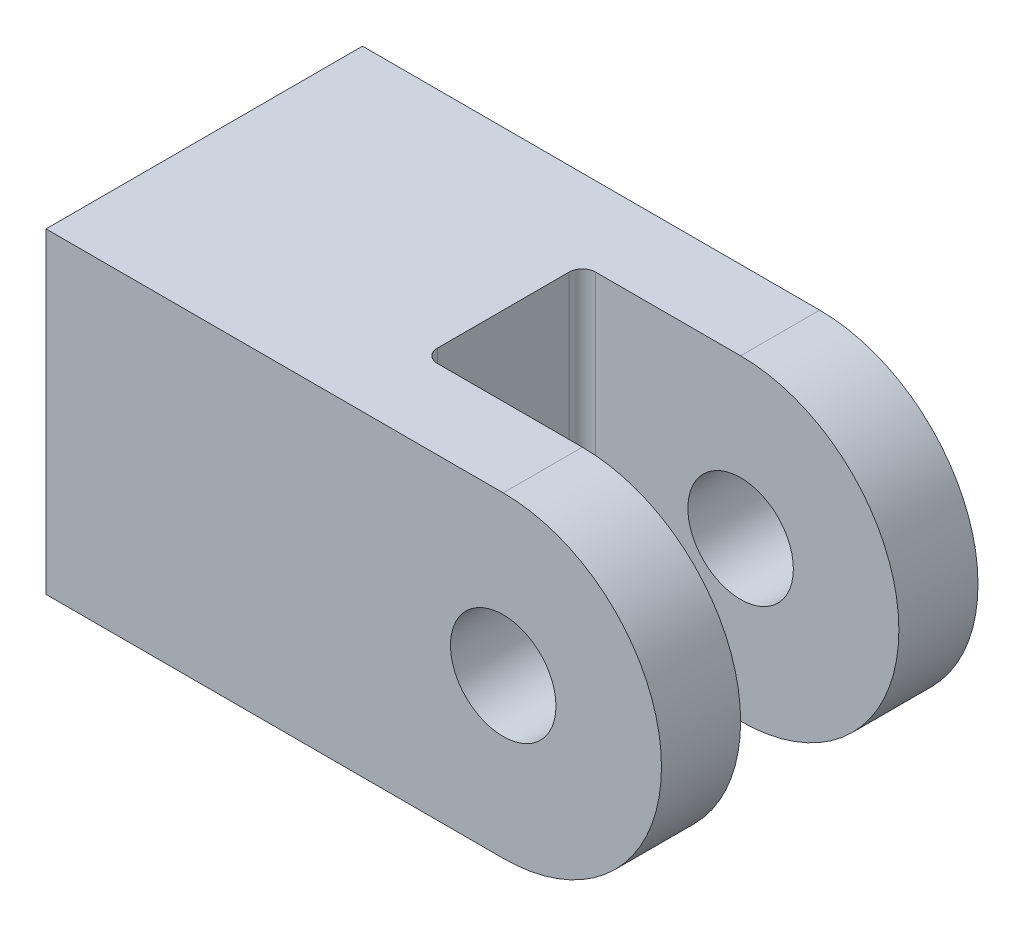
from build123d import *

# Parameters (mm, degrees)
CLEVIS_BODY_EXTRUDE1_DEPTH       = 18
SKETCH2_R                        = 6
PIN_HOLES_CUT_EXTRUDE1_DEPTH     = 18
SKETCH3_R                        = 7.5
THREADED_HOLE_CUT_EXTRUDE2_DEPTH = 25
SKETCH5_W                        = 38
SKETCH5_H                        = 18
CLIVIS_GAP_CUT_EXTRUDE4_DEPTH    = 81.746516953
FILLET2_R                        = 1.5
CHAMFER2_SIZE                    = 0.5


with BuildPart() as part:
    # Sketch1 → Clevis Body Extrude1 (new, symmetric)
    with BuildSketch(Plane.XY):
        with BuildLine():
            Line((0, 0), (52, 0))
            ThreePointArc((52, 0), (70, 18), (52, 36))
            Line((52, 36), (0, 36))
            Line((0, 36), (0, 0))
        make_face()
    extrude(amount=CLEVIS_BODY_EXTRUDE1_DEPTH, both=True)

    # Sketch2 → Pin Holes Cut-Extrude1 (cut, symmetric)
    with BuildSketch(Plane.XY):
        with Locations((52, 18)):
            Circle(SKETCH2_R)
    extrude(amount=PIN_HOLES_CUT_EXTRUDE1_DEPTH, both=True, mode=Mode.SUBTRACT)

    # Sketch3 → Threaded Hole Cut-Extrude2 (cut)
    with BuildSketch(Plane.ZY):
        with Locations((0, 18)):
            Circle(SKETCH3_R)
    extrude(amount=-THREADED_HOLE_CUT_EXTRUDE2_DEPTH, mode=Mode.SUBTRACT)

    # Sketch5 → Clivis Gap Cut-Extrude4 (cut, through all)
    with BuildSketch(Plane(origin=(0, 0, 0), x_dir=(1, 0, 0), z_dir=(0, 1, 0))):
        with Locations((53, 0)):
            Rectangle(SKETCH5_W, SKETCH5_H)
    extrude(amount=CLIVIS_GAP_CUT_EXTRUDE4_DEPTH, mode=Mode.SUBTRACT)

    # Fillet2
    fillet2_edges = [part.edges().sort_by_distance(p)[0] for p in [
        (34, 18, 9),
        (34, 18, -9),
    ]]
    fillet(fillet2_edges, radius=FILLET2_R)

    # Chamfer2
    chamfer2_edges = [part.edges().sort_by_distance(p)[0] for p in [
        (0, 18, -7.5),
    ]]
    chamfer(chamfer2_edges, length=CHAMFER2_SIZE)


solid = part.part
